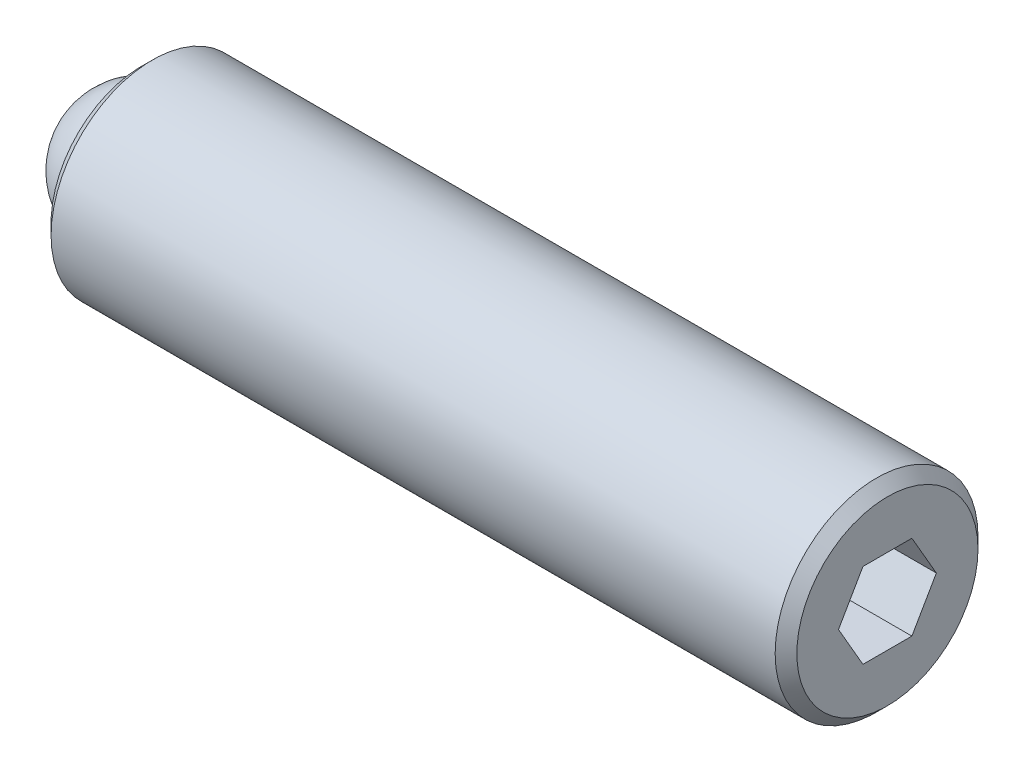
from build123d import *

# Parameters (mm, degrees)
SKETCH2_R           = 2.3749
BOSS_EXTRUDE1_DEPTH = 17.4625
CHAMFER1_SIZE       = 0.254
CHAMFER2_SIZE       = 0.254
CUT_EXTRUDE2_DEPTH  = 2.286
SKETCH3_R           = 1.5875
CUT_EXTRUDE3_DEPTH  = 1.5875


with BuildPart() as part:
    # Sketch2 → Boss-Extrude1 (new body)
    with BuildSketch(Plane(origin=(0, 0, 0), x_dir=(0, 0, -1), z_dir=(1, 0, 0))):
        Circle(SKETCH2_R)
    extrude(amount=BOSS_EXTRUDE1_DEPTH)

    # Chamfer1
    chamfer1_edges = [part.edges().sort_by_distance(p)[0] for p in [
        (0, 0, 2.3749),
    ]]
    chamfer(chamfer1_edges, length=CHAMFER1_SIZE)

    # Chamfer2
    chamfer2_edges = [part.edges().sort_by_distance(p)[0] for p in [
        (17.4625, 0, 2.3749),
    ]]
    chamfer(chamfer2_edges, length=CHAMFER2_SIZE)

    # Sketch4 → Cut-Extrude2 (cut)
    with BuildSketch(Plane(origin=(17.4625, 0, 0), x_dir=(0, 0, -1), z_dir=(1, 0, 0))):
        Polygon((1.14567944, 0), (0.57283972, 0.9921875), (-0.57283972, 0.9921875), (-1.14567944, 0), (-0.57283972, -0.9921875), (0.57283972, -0.9921875), align=None)
    extrude(amount=-CUT_EXTRUDE2_DEPTH, mode=Mode.SUBTRACT)

    # Sketch3 → Cut-Extrude3 (cut)
    with BuildSketch(Plane.ZY):
        Circle(SKETCH3_R)
    extrude(amount=-CUT_EXTRUDE3_DEPTH, mode=Mode.SUBTRACT)


with BuildPart() as body_2:
    # Sketch5 → Revolve1 (revolve)
    with BuildSketch(Plane.ZY):
        with BuildLine():
            Line((0, 0), (0, -1.5875))
            ThreePointArc((0, -1.5875), (-1.5875, 0), (0, 1.5875))
            Line((0, 1.5875), (0, 0))
        make_face()
    revolve(axis=Axis((0, 0, 0), (0, 1, 0)))


solid = Compound([part.part, body_2.part])
